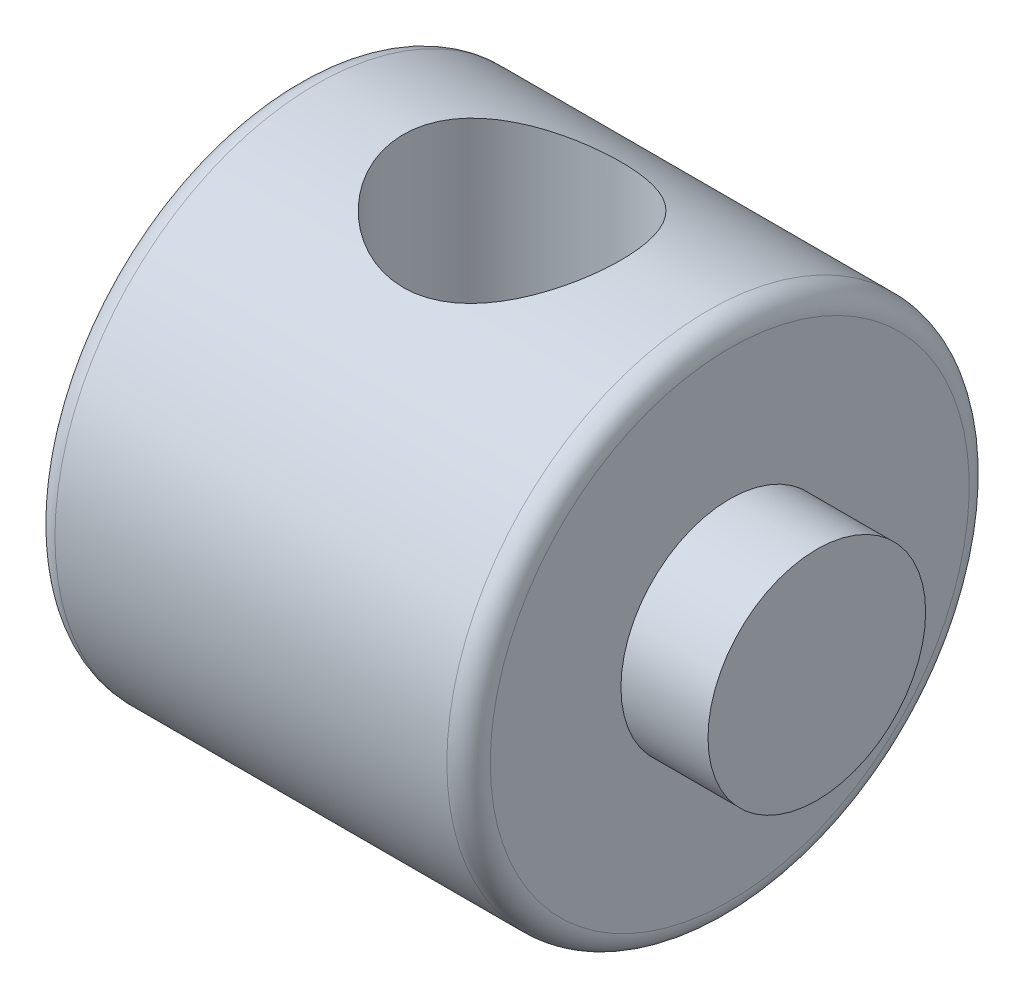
ISO-10303-21;
HEADER;
FILE_DESCRIPTION(('STEP AP214'),'2;1');
FILE_NAME('part.step','',(''),(''),'','','');
FILE_SCHEMA(('AUTOMOTIVE_DESIGN { 1 0 10303 214 1 1 1 1 }'));
ENDSEC;
DATA;
#1=APPLICATION_CONTEXT('core data for automotive mechanical design processes');
#2=APPLICATION_PROTOCOL_DEFINITION('international standard','automotive_design',2000,#1);
#3=PRODUCT_CONTEXT('',#1,'mechanical');
#4=PRODUCT('Part','Part','',(#3));
#5=PRODUCT_RELATED_PRODUCT_CATEGORY('part','',(#4));
#6=PRODUCT_DEFINITION_FORMATION('','',#4);
#7=PRODUCT_DEFINITION_CONTEXT('part definition',#1,'design');
#8=PRODUCT_DEFINITION('design','',#6,#7);
#9=PRODUCT_DEFINITION_SHAPE('','',#8);
#10=(LENGTH_UNIT() NAMED_UNIT(*) SI_UNIT(.MILLI.,.METRE.));
#11=(NAMED_UNIT(*) PLANE_ANGLE_UNIT() SI_UNIT($,.RADIAN.));
#12=(NAMED_UNIT(*) SI_UNIT($,.STERADIAN.) SOLID_ANGLE_UNIT());
#13=UNCERTAINTY_MEASURE_WITH_UNIT(LENGTH_MEASURE(1.E-05),#10,'distance_accuracy_value','');
#14=(GEOMETRIC_REPRESENTATION_CONTEXT(3) GLOBAL_UNCERTAINTY_ASSIGNED_CONTEXT((#13)) GLOBAL_UNIT_ASSIGNED_CONTEXT((#10,
#11,#12)) REPRESENTATION_CONTEXT('',''));
#15=CARTESIAN_POINT('',(0.,0.,0.));
#16=DIRECTION('',(0.,0.,1.));
#17=DIRECTION('',(1.,0.,0.));
#18=AXIS2_PLACEMENT_3D('',#15,#16,#17);
#19=CARTESIAN_POINT('',(-11.1125,0.,0.));
#20=DIRECTION('',(1.,0.,0.));
#21=DIRECTION('',(0.,0.,-1.));
#22=AXIS2_PLACEMENT_3D('',#19,#20,#21);
#23=PLANE('',#22);
#24=CARTESIAN_POINT('',(-11.1125,0.,0.));
#25=DIRECTION('',(-1.,0.,0.));
#26=DIRECTION('',(0.,0.,1.));
#27=AXIS2_PLACEMENT_3D('',#24,#25,#26);
#28=CIRCLE('',#27,3.96875);
#29=CARTESIAN_POINT('',(-11.1125,0.,3.96875));
#30=VERTEX_POINT('',#29);
#31=EDGE_CURVE('E123',#30,#30,#28,.T.);
#32=ORIENTED_EDGE('',*,*,#31,.T.);
#33=EDGE_LOOP('',(#32));
#34=FACE_BOUND('',#33,.T.);
#35=ADVANCED_FACE('F47',(#34),#23,.F.);
#36=CARTESIAN_POINT('',(-58.3897157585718,0.,-1.38777878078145E-13));
#37=DIRECTION('',(-1.,0.,0.));
#38=DIRECTION('',(0.,0.,1.));
#39=AXIS2_PLACEMENT_3D('',#36,#37,#38);
#40=CYLINDRICAL_SURFACE('',#39,3.96875);
#41=ORIENTED_EDGE('',*,*,#31,.F.);
#42=EDGE_LOOP('',(#41));
#43=FACE_BOUND('',#42,.T.);
#44=CARTESIAN_POINT('',(-7.9375,0.,0.));
#45=DIRECTION('',(-1.,0.,0.));
#46=DIRECTION('',(0.,0.,1.));
#47=AXIS2_PLACEMENT_3D('',#44,#45,#46);
#48=CIRCLE('',#47,3.96875);
#49=CARTESIAN_POINT('',(-7.9375,0.,3.96875));
#50=VERTEX_POINT('',#49);
#51=EDGE_CURVE('E127',#50,#50,#48,.T.);
#52=ORIENTED_EDGE('',*,*,#51,.T.);
#53=EDGE_LOOP('',(#52));
#54=FACE_BOUND('',#53,.T.);
#55=ADVANCED_FACE('F100',(#43,#54),#40,.T.);
#56=CARTESIAN_POINT('',(-7.93750000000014,3.96874999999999,-1.38777878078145E-13));
#57=DIRECTION('',(1.,0.,0.));
#58=DIRECTION('',(0.,0.,-1.));
#59=AXIS2_PLACEMENT_3D('',#56,#57,#58);
#60=PLANE('',#59);
#61=CARTESIAN_POINT('',(-7.9375,0.,0.));
#62=DIRECTION('',(1.,0.,0.));
#63=DIRECTION('',(0.,0.,-1.));
#64=AXIS2_PLACEMENT_3D('',#61,#62,#63);
#65=CIRCLE('',#64,8.73252);
#66=CARTESIAN_POINT('',(-7.9375,0.,-8.73252000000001));
#67=VERTEX_POINT('',#66);
#68=EDGE_CURVE('E120',#67,#67,#65,.F.);
#69=ORIENTED_EDGE('',*,*,#68,.T.);
#70=EDGE_LOOP('',(#69));
#71=FACE_BOUND('',#70,.T.);
#72=ORIENTED_EDGE('',*,*,#51,.F.);
#73=EDGE_LOOP('',(#72));
#74=FACE_BOUND('',#73,.T.);
#75=ADVANCED_FACE('F97',(#71,#74),#60,.F.);
#76=CARTESIAN_POINT('',(-58.3897157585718,0.,-1.38777878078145E-13));
#77=DIRECTION('',(-1.,0.,0.));
#78=DIRECTION('',(0.,0.,1.));
#79=AXIS2_PLACEMENT_3D('',#76,#77,#78);
#80=CYLINDRICAL_SURFACE('',#79,9.525);
#81=CARTESIAN_POINT('',(-3.96874999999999,-9.525,0.));
#82=CARTESIAN_POINT('',(-3.96874924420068,-9.52499940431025,0.106339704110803));
#83=CARTESIAN_POINT('',(-3.96447001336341,-9.52321418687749,0.212715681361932));
#84=CARTESIAN_POINT('',(-3.94739427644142,-9.51611852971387,0.424708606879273));
#85=CARTESIAN_POINT('',(-3.93459238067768,-9.51080585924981,0.530325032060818));
#86=CARTESIAN_POINT('',(-3.900564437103,-9.49677884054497,0.74019608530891));
#87=CARTESIAN_POINT('',(-3.87932112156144,-9.48805752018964,0.844447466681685));
#88=CARTESIAN_POINT('',(-3.82863481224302,-9.46744770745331,1.05063078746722));
#89=CARTESIAN_POINT('',(-3.79918846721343,-9.45555792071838,1.15256176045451));
#90=CARTESIAN_POINT('',(-3.69918624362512,-9.41566954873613,1.45304856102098));
#91=CARTESIAN_POINT('',(-3.61681028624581,-9.38338421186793,1.64725042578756));
#92=CARTESIAN_POINT('',(-3.42336419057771,-9.31053593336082,2.01878960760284));
#93=CARTESIAN_POINT('',(-3.3123027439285,-9.2699754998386,2.19613201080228));
#94=CARTESIAN_POINT('',(-3.05870239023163,-9.18234884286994,2.5382409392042));
#95=CARTESIAN_POINT('',(-2.91495316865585,-9.13506952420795,2.7020573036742));
#96=CARTESIAN_POINT('',(-2.60267091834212,-9.0402645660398,3.00405615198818));
#97=CARTESIAN_POINT('',(-2.43412492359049,-8.99273881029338,3.14222513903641));
#98=CARTESIAN_POINT('',(-2.06679786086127,-8.90018838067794,3.39579467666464));
#99=CARTESIAN_POINT('',(-1.86693718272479,-8.8554018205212,3.50974047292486));
#100=CARTESIAN_POINT('',(-1.55355911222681,-8.79645372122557,3.65386256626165));
#101=CARTESIAN_POINT('',(-1.44679096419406,-8.77817079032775,3.69744892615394));
#102=CARTESIAN_POINT('',(-1.22941680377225,-8.74497623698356,3.77528941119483));
#103=CARTESIAN_POINT('',(-1.11881279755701,-8.73006288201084,3.80954833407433));
#104=CARTESIAN_POINT('',(-0.899958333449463,-8.70478736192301,3.8669417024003));
#105=CARTESIAN_POINT('',(-0.791847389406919,-8.69424199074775,3.89052895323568));
#106=CARTESIAN_POINT('',(-0.573771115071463,-8.67709957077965,3.92861373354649));
#107=CARTESIAN_POINT('',(-0.463806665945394,-8.67050069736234,3.94311546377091));
#108=CARTESIAN_POINT('',(-0.242906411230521,-8.66149391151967,3.96286093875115));
#109=CARTESIAN_POINT('',(-0.131970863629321,-8.65908491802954,3.96810707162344));
#110=CARTESIAN_POINT('',(0.0899554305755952,-8.6585465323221,3.96928172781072));
#111=CARTESIAN_POINT('',(0.200946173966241,-8.66041691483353,3.96521074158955));
#112=CARTESIAN_POINT('',(0.413533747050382,-8.66805984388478,3.94847322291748));
#113=CARTESIAN_POINT('',(0.515196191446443,-8.6735210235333,3.93649226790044));
#114=CARTESIAN_POINT('',(0.717069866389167,-8.68784624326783,3.90477208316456));
#115=CARTESIAN_POINT('',(0.817280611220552,-8.69671139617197,3.88503031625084));
#116=CARTESIAN_POINT('',(1.11466693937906,-8.72802607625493,3.81443477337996));
#117=CARTESIAN_POINT('',(1.30877252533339,-8.75520186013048,3.75219655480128));
#118=CARTESIAN_POINT('',(1.68772720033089,-8.81971157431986,3.59796791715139));
#119=CARTESIAN_POINT('',(1.87229142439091,-8.8572493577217,3.50537257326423));
#120=CARTESIAN_POINT('',(2.22400833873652,-8.93820695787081,3.29346810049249));
#121=CARTESIAN_POINT('',(2.39115412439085,-8.9816290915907,3.17414843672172));
#122=CARTESIAN_POINT('',(2.71811992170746,-9.0739270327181,2.90034934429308));
#123=CARTESIAN_POINT('',(2.87612703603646,-9.12295360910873,2.74375071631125));
#124=CARTESIAN_POINT('',(3.16424718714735,-9.21784011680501,2.40579154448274));
#125=CARTESIAN_POINT('',(3.29435368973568,-9.26369930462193,2.22442521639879));
#126=CARTESIAN_POINT('',(3.52563392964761,-9.34841550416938,1.83657221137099));
#127=CARTESIAN_POINT('',(3.62607053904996,-9.38708646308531,1.62960234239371));
#128=CARTESIAN_POINT('',(3.79006456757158,-9.45164103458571,1.19968138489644));
#129=CARTESIAN_POINT('',(3.85364236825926,-9.47753171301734,0.976739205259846));
#130=CARTESIAN_POINT('',(3.93832078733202,-9.51228860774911,0.53634675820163));
#131=CARTESIAN_POINT('',(3.96185345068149,-9.522127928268,0.31944083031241));
#132=CARTESIAN_POINT('',(3.97302425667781,-9.52677959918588,-0.115426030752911));
#133=CARTESIAN_POINT('',(3.9606727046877,-9.52159626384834,-0.333386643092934));
#134=CARTESIAN_POINT('',(3.90216680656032,-9.49741616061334,-0.752786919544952));
#135=CARTESIAN_POINT('',(3.8577203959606,-9.47911767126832,-0.954509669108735));
#136=CARTESIAN_POINT('',(3.73866348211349,-9.43129326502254,-1.34741522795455));
#137=CARTESIAN_POINT('',(3.66404916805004,-9.40176592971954,-1.53859670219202));
#138=CARTESIAN_POINT('',(3.48433715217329,-9.33317509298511,-1.91169607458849));
#139=CARTESIAN_POINT('',(3.37836451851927,-9.2938438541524,-2.09314172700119));
#140=CARTESIAN_POINT('',(3.13990552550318,-9.20984329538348,-2.43632423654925));
#141=CARTESIAN_POINT('',(3.00740809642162,-9.16517174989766,-2.59805281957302));
#142=CARTESIAN_POINT('',(2.70858223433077,-9.07135879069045,-2.90935864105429));
#143=CARTESIAN_POINT('',(2.54051275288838,-9.02212608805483,-3.05724146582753));
#144=CARTESIAN_POINT('',(2.1811574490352,-8.92760269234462,-3.32317676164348));
#145=CARTESIAN_POINT('',(1.98986636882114,-8.88231289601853,-3.44122245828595));
#146=CARTESIAN_POINT('',(1.58554999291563,-8.80050901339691,-3.64540673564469));
#147=CARTESIAN_POINT('',(1.37225393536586,-8.76412911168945,-3.73106690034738));
#148=CARTESIAN_POINT('',(0.932273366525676,-8.70611529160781,-3.86452789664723));
#149=CARTESIAN_POINT('',(0.705600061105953,-8.68446921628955,-3.91235994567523));
#150=CARTESIAN_POINT('',(0.264100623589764,-8.66023047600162,-3.96570453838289));
#151=CARTESIAN_POINT('',(0.0497056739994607,-8.6562994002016,-3.97419128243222));
#152=CARTESIAN_POINT('',(-0.377326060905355,-8.66437982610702,-3.95654456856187));
#153=CARTESIAN_POINT('',(-0.589963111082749,-8.67638888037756,-3.93041642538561));
#154=CARTESIAN_POINT('',(-0.997244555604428,-8.71377327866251,-3.84677918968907));
#155=CARTESIAN_POINT('',(-1.19226573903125,-8.7385003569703,-3.79078759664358));
#156=CARTESIAN_POINT('',(-1.57018966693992,-8.79802591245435,-3.65049901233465));
#157=CARTESIAN_POINT('',(-1.75308898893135,-8.83282721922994,-3.56619406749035));
#158=CARTESIAN_POINT('',(-2.11358565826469,-8.91117616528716,-3.36582424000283));
#159=CARTESIAN_POINT('',(-2.29020295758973,-8.95512388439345,-3.24815448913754));
#160=CARTESIAN_POINT('',(-2.62210138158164,-9.04569075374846,-2.98668090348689));
#161=CARTESIAN_POINT('',(-2.77737507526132,-9.09231082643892,-2.84286800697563));
#162=CARTESIAN_POINT('',(-3.07389036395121,-9.18707098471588,-2.52060299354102));
#163=CARTESIAN_POINT('',(-3.21328628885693,-9.23507447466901,-2.34039087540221));
#164=CARTESIAN_POINT('',(-3.39817492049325,-9.30155622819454,-2.05338852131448));
#165=CARTESIAN_POINT('',(-3.45580765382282,-9.32281142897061,-1.95485248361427));
#166=CARTESIAN_POINT('',(-3.56253706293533,-9.3628985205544,-1.75280765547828));
#167=CARTESIAN_POINT('',(-3.6116376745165,-9.38173152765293,-1.64930118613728));
#168=CARTESIAN_POINT('',(-3.70013143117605,-9.41615560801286,-1.4397022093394));
#169=CARTESIAN_POINT('',(-3.739667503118,-9.43179378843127,-1.33367770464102));
#170=CARTESIAN_POINT('',(-3.80962337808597,-9.45974893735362,-1.1182834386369));
#171=CARTESIAN_POINT('',(-3.84004750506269,-9.47206748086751,-1.00891529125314));
#172=CARTESIAN_POINT('',(-3.89140117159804,-9.49300284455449,-0.787917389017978));
#173=CARTESIAN_POINT('',(-3.91235415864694,-9.50162880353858,-0.676293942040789));
#174=CARTESIAN_POINT('',(-3.94461831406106,-9.51495896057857,-0.451486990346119));
#175=CARTESIAN_POINT('',(-3.95593655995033,-9.51966603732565,-0.338304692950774));
#176=CARTESIAN_POINT('',(-3.96450008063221,-9.52322990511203,-0.187413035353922));
#177=CARTESIAN_POINT('',(-3.96609336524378,-9.52389333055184,-0.149952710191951));
#178=CARTESIAN_POINT('',(-3.968218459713,-9.52477848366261,-0.0749964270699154));
#179=CARTESIAN_POINT('',(-3.968750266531,-9.52500021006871,-0.0375004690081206));
#180=CARTESIAN_POINT('',(-3.96874999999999,-9.525,0.));
#181=B_SPLINE_CURVE_WITH_KNOTS('',3,(#81,#82,#83,#84,#85,#86,#87,#88,#89,#90,#91,#92,#93,#94,
#95,#96,#97,#98,#99,#100,#101,#102,#103,#104,#105,#106,#107,#108,#109,#110,#111,#112,#113,#114,
#115,#116,#117,#118,#119,#120,#121,#122,#123,#124,#125,#126,#127,#128,#129,#130,#131,#132,#133,
#134,#135,#136,#137,#138,#139,#140,#141,#142,#143,#144,#145,#146,#147,#148,#149,#150,#151,#152,
#153,#154,#155,#156,#157,#158,#159,#160,#161,#162,#163,#164,#165,#166,#167,#168,#169,#170,#171,
#172,#173,#174,#175,#176,#177,#178,#179,#180),.UNSPECIFIED.,.T.,.F.,(4,2,2,2,2,2,2,2,2,2,2,2,2,
2,2,2,2,2,2,2,2,2,2,2,2,2,2,2,2,2,2,2,2,2,2,2,2,2,2,2,2,2,2,2,2,2,2,2,2,4),(0.,0.31898074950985,
0.638163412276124,0.958002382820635,1.27797221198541,1.91504647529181,2.5519279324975,
3.21802682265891,3.88447525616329,4.58371459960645,4.93360722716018,5.28331953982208,
5.61634537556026,5.94921712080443,6.28200296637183,6.61477129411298,6.92193148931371,
7.2291921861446,7.84319027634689,8.47025383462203,9.09756502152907,9.77789117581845,
10.4583764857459,11.1545684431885,11.8503750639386,12.5021777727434,13.1537933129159,
13.7730714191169,14.3924277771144,15.0310237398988,15.6698867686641,16.3544066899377,
17.0390818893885,17.7335092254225,18.4273628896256,19.0678058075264,19.7081504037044,
20.3186850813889,20.9293914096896,21.5768183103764,22.2244700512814,22.9192921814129,
23.2672758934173,23.6150986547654,23.9573486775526,24.2994360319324,24.6406717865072,
24.9816566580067,25.0941442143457,25.2066320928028),.UNSPECIFIED.);
#182=CARTESIAN_POINT('',(-3.96874999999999,-9.525,0.));
#183=VERTEX_POINT('',#182);
#184=EDGE_CURVE('E10',#183,#183,#181,.T.);
#185=ORIENTED_EDGE('',*,*,#184,.T.);
#186=EDGE_LOOP('',(#185));
#187=FACE_BOUND('',#186,.T.);
#188=CARTESIAN_POINT('',(0.,8.65879024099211,3.96874999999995));
#189=CARTESIAN_POINT('',(-0.10588737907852,8.65879102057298,3.96874923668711));
#190=CARTESIAN_POINT('',(-0.211812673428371,8.66073940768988,3.96450596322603));
#191=CARTESIAN_POINT('',(-0.422891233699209,8.66846838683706,3.94757702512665));
#192=CARTESIAN_POINT('',(-0.528043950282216,8.67425148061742,3.93488584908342));
#193=CARTESIAN_POINT('',(-0.736974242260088,8.68947118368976,3.90116132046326));
#194=CARTESIAN_POINT('',(-0.840748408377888,8.69891555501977,3.88011024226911));
#195=CARTESIAN_POINT('',(-1.04596468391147,8.72113840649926,3.82989753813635));
#196=CARTESIAN_POINT('',(-1.14740579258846,8.73391828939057,3.80073249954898));
#197=CARTESIAN_POINT('',(-1.44629317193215,8.7765475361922,3.70176138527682));
#198=CARTESIAN_POINT('',(-1.63939720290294,8.81077287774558,3.62029961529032));
#199=CARTESIAN_POINT('',(-2.00904168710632,8.88695862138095,3.42901239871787));
#200=CARTESIAN_POINT('',(-2.18558604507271,8.92891719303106,3.3191936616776));
#201=CARTESIAN_POINT('',(-2.52832534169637,9.01876991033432,3.06696935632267));
#202=CARTESIAN_POINT('',(-2.69337412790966,9.06686538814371,2.92307464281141));
#203=CARTESIAN_POINT('',(-2.99783807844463,9.16191652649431,2.60991820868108));
#204=CARTESIAN_POINT('',(-3.13724335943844,9.20887174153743,2.44064675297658));
#205=CARTESIAN_POINT('',(-3.39232658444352,9.2987982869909,2.0725239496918));
#206=CARTESIAN_POINT('',(-3.50671311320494,9.34150848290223,1.87270805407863));
#207=CARTESIAN_POINT('',(-3.6997515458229,9.41566952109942,1.45456912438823));
#208=CARTESIAN_POINT('',(-3.7784193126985,9.44712536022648,1.2362543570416));
#209=CARTESIAN_POINT('',(-3.8936277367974,9.49380629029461,0.799364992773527));
#210=CARTESIAN_POINT('',(-3.93214761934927,9.5097908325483,0.581395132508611));
#211=CARTESIAN_POINT('',(-3.97236202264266,9.52648680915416,0.141538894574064));
#212=CARTESIAN_POINT('',(-3.97407148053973,9.52720443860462,-0.0803458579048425));
#213=CARTESIAN_POINT('',(-3.94165365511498,9.51373284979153,-0.507342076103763));
#214=CARTESIAN_POINT('',(-3.9097010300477,9.50044819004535,-0.712652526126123));
#215=CARTESIAN_POINT('',(-3.81459389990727,9.46170690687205,-1.11468818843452));
#216=CARTESIAN_POINT('',(-3.75143709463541,9.43624938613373,-1.31141276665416));
#217=CARTESIAN_POINT('',(-3.59496346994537,9.37513531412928,-1.69430102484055));
#218=CARTESIAN_POINT('',(-3.50120120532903,9.33932908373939,-1.88025778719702));
#219=CARTESIAN_POINT('',(-3.28661472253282,9.26102141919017,-2.23428486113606));
#220=CARTESIAN_POINT('',(-3.16578094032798,9.2185176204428,-2.40234882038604));
#221=CARTESIAN_POINT('',(-2.89057581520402,9.12754393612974,-2.72840739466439));
#222=CARTESIAN_POINT('',(-2.73444083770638,9.07886469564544,-2.88485718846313));
#223=CARTESIAN_POINT('',(-2.39804117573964,8.98327707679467,-3.17001974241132));
#224=CARTESIAN_POINT('',(-2.21776722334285,8.93636938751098,-3.29872179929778));
#225=CARTESIAN_POINT('',(-1.83072075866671,8.84814119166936,-3.52870100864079));
#226=CARTESIAN_POINT('',(-1.62327207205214,8.80705498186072,-3.62893779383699));
#227=CARTESIAN_POINT('',(-1.19227268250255,8.73791255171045,-3.79242421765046));
#228=CARTESIAN_POINT('',(-0.968733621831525,8.70984701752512,-3.85570030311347));
#229=CARTESIAN_POINT('',(-0.527377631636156,8.67223349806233,-3.93954079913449));
#230=CARTESIAN_POINT('',(-0.310130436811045,8.66160222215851,-3.96261001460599));
#231=CARTESIAN_POINT('',(0.125344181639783,8.65696410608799,-3.97273876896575));
#232=CARTESIAN_POINT('',(0.343571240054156,8.66295151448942,-3.95981076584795));
#233=CARTESIAN_POINT('',(0.760089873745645,8.689756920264,-3.90059791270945));
#234=CARTESIAN_POINT('',(0.958763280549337,8.70960088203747,-3.85650164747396));
#235=CARTESIAN_POINT('',(1.34572786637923,8.76063876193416,-3.73910410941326));
#236=CARTESIAN_POINT('',(1.53401660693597,8.79183533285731,-3.6657960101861));
#237=CARTESIAN_POINT('',(1.9037786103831,8.86367283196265,-3.4886112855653));
#238=CARTESIAN_POINT('',(2.08462554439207,8.9046577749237,-3.38357156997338));
#239=CARTESIAN_POINT('',(2.42699556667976,8.99096511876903,-3.14706249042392));
#240=CARTESIAN_POINT('',(2.58851024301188,9.03628939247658,-3.01558168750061));
#241=CARTESIAN_POINT('',(2.90131542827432,9.13062117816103,-2.71730614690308));
#242=CARTESIAN_POINT('',(3.05070319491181,9.17962815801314,-2.54850792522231));
#243=CARTESIAN_POINT('',(3.31937452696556,9.27237671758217,-2.18710355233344));
#244=CARTESIAN_POINT('',(3.43865588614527,9.3161179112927,-1.99449565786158));
#245=CARTESIAN_POINT('',(3.64359785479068,9.39368998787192,-1.58957861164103));
#246=CARTESIAN_POINT('',(3.72917161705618,9.42749521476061,-1.37722028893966));
#247=CARTESIAN_POINT('',(3.86275831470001,9.48112699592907,-0.93935180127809));
#248=CARTESIAN_POINT('',(3.9107936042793,9.50096186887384,-0.713849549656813));
#249=CARTESIAN_POINT('',(3.96512455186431,9.52346123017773,-0.273102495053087));
#250=CARTESIAN_POINT('',(3.97410306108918,9.52722899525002,-0.0582424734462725));
#251=CARTESIAN_POINT('',(3.95727826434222,9.52022236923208,0.369845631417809));
#252=CARTESIAN_POINT('',(3.93148105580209,9.50945052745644,0.583073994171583));
#253=CARTESIAN_POINT('',(3.84776326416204,9.47515459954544,0.994049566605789));
#254=CARTESIAN_POINT('',(3.79101467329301,9.45209643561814,1.19207762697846));
#255=CARTESIAN_POINT('',(3.64828360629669,9.39576160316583,1.57572788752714));
#256=CARTESIAN_POINT('',(3.56229557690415,9.3624829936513,1.76134772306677));
#257=CARTESIAN_POINT('',(3.35918386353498,9.28706002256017,2.12415277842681));
#258=CARTESIAN_POINT('',(3.24082867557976,9.2445829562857,2.30057768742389));
#259=CARTESIAN_POINT('',(2.97812483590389,9.15579683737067,2.63181762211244));
#260=CARTESIAN_POINT('',(2.83376653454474,9.10948636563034,2.78662458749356));
#261=CARTESIAN_POINT('',(2.51160959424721,9.01429734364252,3.08117477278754));
#262=CARTESIAN_POINT('',(2.33220388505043,8.96545847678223,3.21917615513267));
#263=CARTESIAN_POINT('',(1.95113222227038,8.87397991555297,3.46340851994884));
#264=CARTESIAN_POINT('',(1.74945391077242,8.83134369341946,3.56962174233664));
#265=CARTESIAN_POINT('',(1.43492580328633,8.77627475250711,3.70200982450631));
#266=CARTESIAN_POINT('',(1.3283156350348,8.75942523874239,3.74159595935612));
#267=CARTESIAN_POINT('',(1.11165942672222,8.72920169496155,3.81157741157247));
#268=CARTESIAN_POINT('',(1.00161510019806,8.71582596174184,3.84197723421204));
#269=CARTESIAN_POINT('',(0.779229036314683,8.693079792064,3.89316985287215));
#270=CARTESIAN_POINT('',(0.666894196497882,8.68369878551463,3.91398801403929));
#271=CARTESIAN_POINT('',(0.44063009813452,8.66926072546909,3.94586543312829));
#272=CARTESIAN_POINT('',(0.32670214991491,8.66420030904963,3.95693228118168));
#273=CARTESIAN_POINT('',(0.177123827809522,8.66052913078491,3.96495416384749));
#274=CARTESIAN_POINT('',(0.141718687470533,8.65987747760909,3.96637719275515));
#275=CARTESIAN_POINT('',(0.0708771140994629,8.65900790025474,3.96827524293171));
#276=CARTESIAN_POINT('',(0.0354406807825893,8.65878998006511,3.96875025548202));
#277=CARTESIAN_POINT('',(0.,8.65879024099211,3.96874999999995));
#278=B_SPLINE_CURVE_WITH_KNOTS('',3,(#188,#189,#190,#191,#192,#193,#194,#195,#196,#197,#198,
#199,#200,#201,#202,#203,#204,#205,#206,#207,#208,#209,#210,#211,#212,#213,#214,#215,#216,#217,
#218,#219,#220,#221,#222,#223,#224,#225,#226,#227,#228,#229,#230,#231,#232,#233,#234,#235,#236,
#237,#238,#239,#240,#241,#242,#243,#244,#245,#246,#247,#248,#249,#250,#251,#252,#253,#254,#255,
#256,#257,#258,#259,#260,#261,#262,#263,#264,#265,#266,#267,#268,#269,#270,#271,#272,#273,#274,
#275,#276,#277),.UNSPECIFIED.,.T.,.F.,(4,2,2,2,2,2,2,2,2,2,2,2,2,2,2,2,2,2,2,2,2,2,2,2,2,2,2,2,
2,2,2,2,2,2,2,2,2,2,2,2,2,2,2,2,4),(0.,0.317624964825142,0.635457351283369,0.953967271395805,
1.27261135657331,1.90660643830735,2.54045164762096,3.21006383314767,3.87993355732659,
4.57885824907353,5.27747223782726,5.93973085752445,6.60172073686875,7.22342254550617,
7.84517018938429,8.47640373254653,9.10786063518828,9.78382800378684,10.4600556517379,
11.158508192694,11.8564603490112,12.5091288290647,13.1615714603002,13.772242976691,
14.383057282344,15.0197393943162,15.6566975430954,16.3455094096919,17.0343717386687,
17.7249974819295,18.4152116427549,19.0571807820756,19.6990373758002,20.3181250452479,
20.9373303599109,21.5845197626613,22.2319498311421,22.923435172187,23.6153061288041,
23.9598103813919,24.3041454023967,24.6475635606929,24.9907141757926,25.0970227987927,
25.2033323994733),.UNSPECIFIED.);
#279=CARTESIAN_POINT('',(0.,8.65879024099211,3.96874999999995));
#280=VERTEX_POINT('',#279);
#281=EDGE_CURVE('E59',#280,#280,#278,.T.);
#282=ORIENTED_EDGE('',*,*,#281,.T.);
#283=EDGE_LOOP('',(#282));
#284=FACE_BOUND('',#283,.T.);
#285=CARTESIAN_POINT('',(-7.14502,0.,0.));
#286=DIRECTION('',(1.,0.,0.));
#287=DIRECTION('',(0.,0.,-1.));
#288=AXIS2_PLACEMENT_3D('',#285,#286,#287);
#289=CIRCLE('',#288,9.525);
#290=CARTESIAN_POINT('',(-7.14502,0.,-9.52500000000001));
#291=VERTEX_POINT('',#290);
#292=EDGE_CURVE('E67',#291,#291,#289,.T.);
#293=ORIENTED_EDGE('',*,*,#292,.T.);
#294=EDGE_LOOP('',(#293));
#295=FACE_BOUND('',#294,.T.);
#296=CARTESIAN_POINT('',(7.14502,0.,0.));
#297=DIRECTION('',(-1.,0.,0.));
#298=DIRECTION('',(0.,0.,1.));
#299=AXIS2_PLACEMENT_3D('',#296,#297,#298);
#300=CIRCLE('',#299,9.525);
#301=CARTESIAN_POINT('',(7.14502,0.,9.52500000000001));
#302=VERTEX_POINT('',#301);
#303=EDGE_CURVE('E122',#302,#302,#300,.T.);
#304=ORIENTED_EDGE('',*,*,#303,.T.);
#305=EDGE_LOOP('',(#304));
#306=FACE_BOUND('',#305,.T.);
#307=ADVANCED_FACE('F73',(#187,#284,#295,#306),#80,.T.);
#308=CARTESIAN_POINT('',(7.93749999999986,9.52499999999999,0.));
#309=DIRECTION('',(-1.,0.,0.));
#310=DIRECTION('',(0.,0.,1.));
#311=AXIS2_PLACEMENT_3D('',#308,#309,#310);
#312=PLANE('',#311);
#313=CARTESIAN_POINT('',(7.9375,0.,0.));
#314=DIRECTION('',(-1.,0.,0.));
#315=DIRECTION('',(0.,0.,1.));
#316=AXIS2_PLACEMENT_3D('',#313,#314,#315);
#317=CIRCLE('',#316,8.73252);
#318=CARTESIAN_POINT('',(7.9375,0.,8.73252000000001));
#319=VERTEX_POINT('',#318);
#320=EDGE_CURVE('E63',#319,#319,#317,.F.);
#321=ORIENTED_EDGE('',*,*,#320,.T.);
#322=EDGE_LOOP('',(#321));
#323=FACE_BOUND('',#322,.T.);
#324=CARTESIAN_POINT('',(7.9375,0.,0.));
#325=DIRECTION('',(-1.,0.,0.));
#326=DIRECTION('',(0.,0.,1.));
#327=AXIS2_PLACEMENT_3D('',#324,#325,#326);
#328=CIRCLE('',#327,3.96875);
#329=CARTESIAN_POINT('',(7.9375,0.,3.96875));
#330=VERTEX_POINT('',#329);
#331=EDGE_CURVE('E136',#330,#330,#328,.T.);
#332=ORIENTED_EDGE('',*,*,#331,.T.);
#333=EDGE_LOOP('',(#332));
#334=FACE_BOUND('',#333,.T.);
#335=ADVANCED_FACE('F90',(#323,#334),#312,.F.);
#336=CARTESIAN_POINT('',(-58.3897157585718,0.,-1.38777878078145E-13));
#337=DIRECTION('',(-1.,0.,0.));
#338=DIRECTION('',(0.,0.,1.));
#339=AXIS2_PLACEMENT_3D('',#336,#337,#338);
#340=CYLINDRICAL_SURFACE('',#339,3.96875);
#341=ORIENTED_EDGE('',*,*,#331,.F.);
#342=EDGE_LOOP('',(#341));
#343=FACE_BOUND('',#342,.T.);
#344=CARTESIAN_POINT('',(11.1125,0.,0.));
#345=DIRECTION('',(-1.,0.,0.));
#346=DIRECTION('',(0.,0.,1.));
#347=AXIS2_PLACEMENT_3D('',#344,#345,#346);
#348=CIRCLE('',#347,3.96875);
#349=CARTESIAN_POINT('',(11.1125,0.,3.96875));
#350=VERTEX_POINT('',#349);
#351=EDGE_CURVE('E139',#350,#350,#348,.T.);
#352=ORIENTED_EDGE('',*,*,#351,.T.);
#353=EDGE_LOOP('',(#352));
#354=FACE_BOUND('',#353,.T.);
#355=ADVANCED_FACE('F87',(#343,#354),#340,.T.);
#356=CARTESIAN_POINT('',(11.1124999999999,3.96875,0.));
#357=DIRECTION('',(-1.,0.,0.));
#358=DIRECTION('',(0.,0.,1.));
#359=AXIS2_PLACEMENT_3D('',#356,#357,#358);
#360=PLANE('',#359);
#361=ORIENTED_EDGE('',*,*,#351,.F.);
#362=EDGE_LOOP('',(#361));
#363=FACE_BOUND('',#362,.T.);
#364=ADVANCED_FACE('F82',(#363),#360,.F.);
#365=CARTESIAN_POINT('',(-7.14502,0.,0.));
#366=DIRECTION('',(1.,0.,0.));
#367=DIRECTION('',(0.,0.,-1.));
#368=AXIS2_PLACEMENT_3D('',#365,#366,#367);
#369=TOROIDAL_SURFACE('',#368,8.73252,0.79248);
#370=ORIENTED_EDGE('',*,*,#292,.F.);
#371=EDGE_LOOP('',(#370));
#372=FACE_BOUND('',#371,.T.);
#373=ORIENTED_EDGE('',*,*,#68,.F.);
#374=EDGE_LOOP('',(#373));
#375=FACE_BOUND('',#374,.T.);
#376=ADVANCED_FACE('F86',(#372,#375),#369,.T.);
#377=CARTESIAN_POINT('',(7.14502,0.,0.));
#378=DIRECTION('',(-1.,0.,0.));
#379=DIRECTION('',(0.,0.,1.));
#380=AXIS2_PLACEMENT_3D('',#377,#378,#379);
#381=TOROIDAL_SURFACE('',#380,8.73252,0.79248);
#382=ORIENTED_EDGE('',*,*,#320,.F.);
#383=EDGE_LOOP('',(#382));
#384=FACE_BOUND('',#383,.T.);
#385=ORIENTED_EDGE('',*,*,#303,.F.);
#386=EDGE_LOOP('',(#385));
#387=FACE_BOUND('',#386,.T.);
#388=ADVANCED_FACE('F49',(#384,#387),#381,.T.);
#389=CARTESIAN_POINT('',(-1.38777880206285E-13,9.52499999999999,0.));
#390=DIRECTION('',(0.,1.,0.));
#391=DIRECTION('',(0.,0.,1.));
#392=AXIS2_PLACEMENT_3D('',#389,#390,#391);
#393=CYLINDRICAL_SURFACE('',#392,3.96874999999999);
#394=ORIENTED_EDGE('',*,*,#281,.F.);
#395=EDGE_LOOP('',(#394));
#396=FACE_BOUND('',#395,.T.);
#397=ORIENTED_EDGE('',*,*,#184,.F.);
#398=EDGE_LOOP('',(#397));
#399=FACE_BOUND('',#398,.T.);
#400=ADVANCED_FACE('F77',(#396,#399),#393,.F.);
#401=CLOSED_SHELL('',(#35,#55,#75,#307,#335,#355,#364,#376,#388,#400));
#402=MANIFOLD_SOLID_BREP('B2',#401);
#403=ADVANCED_BREP_SHAPE_REPRESENTATION('',(#18,#402),#14);
#404=SHAPE_DEFINITION_REPRESENTATION(#9,#403);
ENDSEC;
END-ISO-10303-21;
